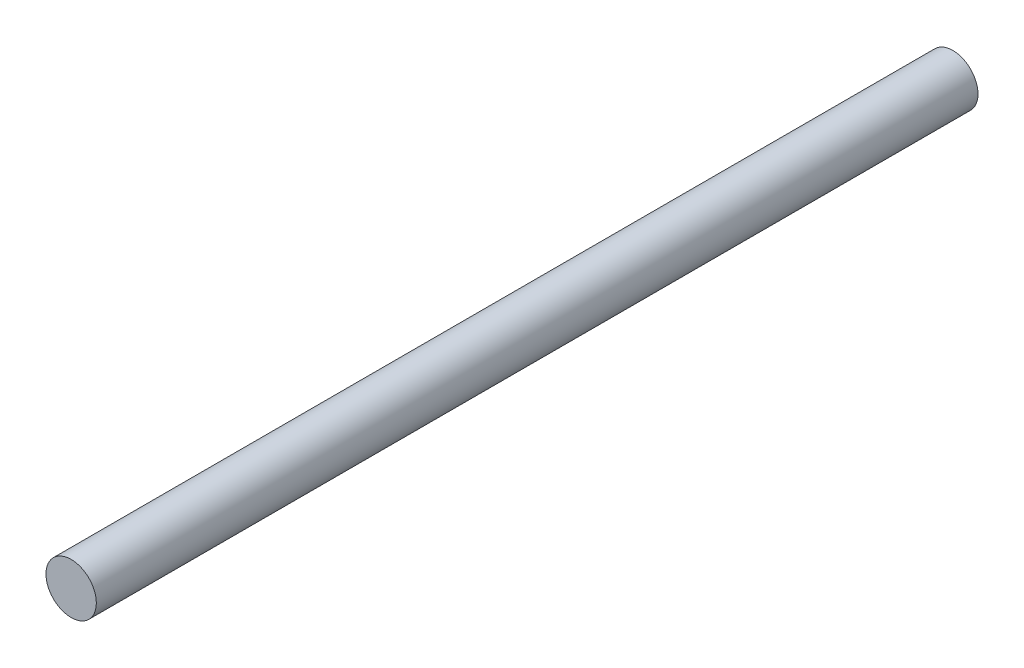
from build123d import *

# Parameters (mm, degrees)
SKETCH1_R           = 30
BOSS_EXTRUDE1_DEPTH = 1050


with BuildPart() as part:
    # Sketch1 → Boss-Extrude1 (new body)
    with BuildSketch(Plane.XY):
        Circle(SKETCH1_R)
    extrude(amount=-BOSS_EXTRUDE1_DEPTH)


solid = part.part
